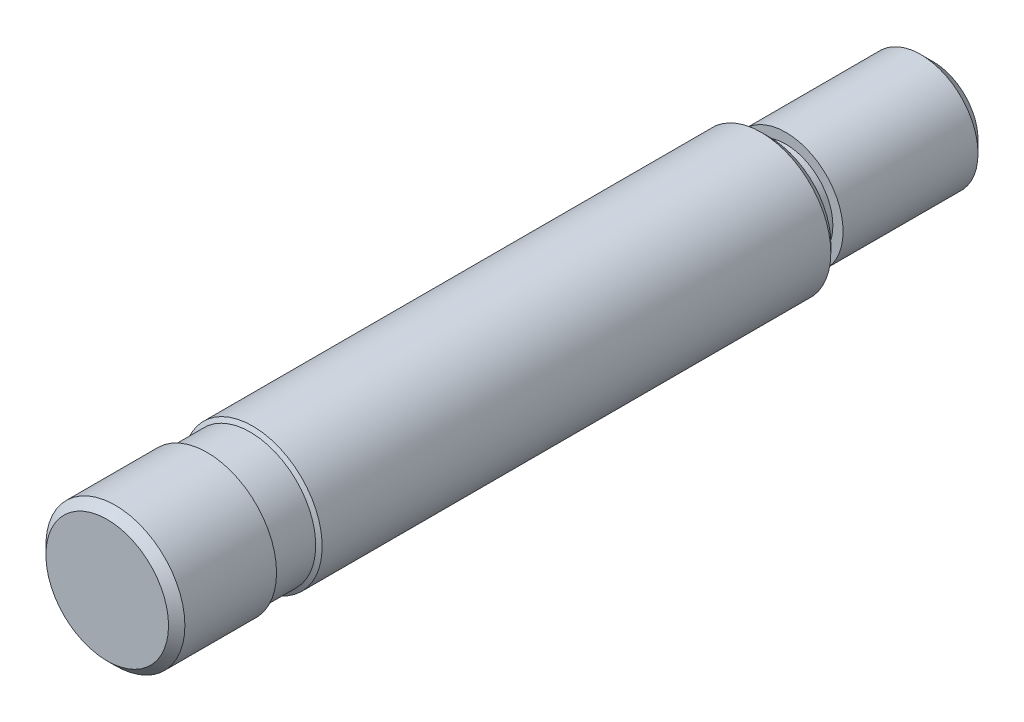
ISO-10303-21;
HEADER;
FILE_DESCRIPTION(('STEP AP214'),'2;1');
FILE_NAME('part.step','',(''),(''),'','','');
FILE_SCHEMA(('AUTOMOTIVE_DESIGN { 1 0 10303 214 1 1 1 1 }'));
ENDSEC;
DATA;
#1=APPLICATION_CONTEXT('core data for automotive mechanical design processes');
#2=APPLICATION_PROTOCOL_DEFINITION('international standard','automotive_design',2000,#1);
#3=PRODUCT_CONTEXT('',#1,'mechanical');
#4=PRODUCT('Part','Part','',(#3));
#5=PRODUCT_RELATED_PRODUCT_CATEGORY('part','',(#4));
#6=PRODUCT_DEFINITION_FORMATION('','',#4);
#7=PRODUCT_DEFINITION_CONTEXT('part definition',#1,'design');
#8=PRODUCT_DEFINITION('design','',#6,#7);
#9=PRODUCT_DEFINITION_SHAPE('','',#8);
#10=(LENGTH_UNIT() NAMED_UNIT(*) SI_UNIT(.MILLI.,.METRE.));
#11=(NAMED_UNIT(*) PLANE_ANGLE_UNIT() SI_UNIT($,.RADIAN.));
#12=(NAMED_UNIT(*) SI_UNIT($,.STERADIAN.) SOLID_ANGLE_UNIT());
#13=UNCERTAINTY_MEASURE_WITH_UNIT(LENGTH_MEASURE(1.E-05),#10,'distance_accuracy_value','');
#14=(GEOMETRIC_REPRESENTATION_CONTEXT(3) GLOBAL_UNCERTAINTY_ASSIGNED_CONTEXT((#13)) GLOBAL_UNIT_ASSIGNED_CONTEXT((#10,
#11,#12)) REPRESENTATION_CONTEXT('',''));
#15=CARTESIAN_POINT('',(0.,0.,0.));
#16=DIRECTION('',(0.,0.,1.));
#17=DIRECTION('',(1.,0.,0.));
#18=AXIS2_PLACEMENT_3D('',#15,#16,#17);
#19=CARTESIAN_POINT('',(0.,0.,81.));
#20=DIRECTION('',(0.,0.,-1.));
#21=DIRECTION('',(-1.,0.,0.));
#22=AXIS2_PLACEMENT_3D('',#19,#20,#21);
#23=CYLINDRICAL_SURFACE('',#22,8.5);
#24=CARTESIAN_POINT('',(0.,0.,63.2113248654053));
#25=DIRECTION('',(0.,0.,-1.));
#26=DIRECTION('',(-1.,0.,0.));
#27=AXIS2_PLACEMENT_3D('',#24,#25,#26);
#28=CIRCLE('',#27,8.5);
#29=CARTESIAN_POINT('',(-8.49999999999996,0.,63.2113248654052));
#30=VERTEX_POINT('',#29);
#31=EDGE_CURVE('E32',#30,#30,#28,.T.);
#32=ORIENTED_EDGE('',*,*,#31,.T.);
#33=EDGE_LOOP('',(#32));
#34=FACE_BOUND('',#33,.T.);
#35=CARTESIAN_POINT('',(0.,0.,1.));
#36=DIRECTION('',(0.,0.,1.));
#37=DIRECTION('',(1.,0.,0.));
#38=AXIS2_PLACEMENT_3D('',#35,#36,#37);
#39=CIRCLE('',#38,8.5);
#40=CARTESIAN_POINT('',(8.5,0.,1.));
#41=VERTEX_POINT('',#40);
#42=EDGE_CURVE('E41',#41,#41,#39,.T.);
#43=ORIENTED_EDGE('',*,*,#42,.T.);
#44=EDGE_LOOP('',(#43));
#45=FACE_BOUND('',#44,.T.);
#46=ADVANCED_FACE('F28',(#34,#45),#23,.T.);
#47=CARTESIAN_POINT('',(0.,0.,0.));
#48=DIRECTION('',(0.,0.,1.));
#49=DIRECTION('',(1.,0.,0.));
#50=AXIS2_PLACEMENT_3D('',#47,#48,#49);
#51=PLANE('',#50);
#52=CARTESIAN_POINT('',(0.,0.,0.));
#53=DIRECTION('',(0.,0.,1.));
#54=DIRECTION('',(1.,0.,0.));
#55=AXIS2_PLACEMENT_3D('',#52,#53,#54);
#56=CIRCLE('',#55,7.49999999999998);
#57=CARTESIAN_POINT('',(7.49999999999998,0.,0.));
#58=VERTEX_POINT('',#57);
#59=EDGE_CURVE('E36',#58,#58,#56,.F.);
#60=ORIENTED_EDGE('',*,*,#59,.T.);
#61=EDGE_LOOP('',(#60));
#62=FACE_BOUND('',#61,.T.);
#63=CARTESIAN_POINT('',(0.,0.,0.));
#64=DIRECTION('',(0.,0.,1.));
#65=DIRECTION('',(1.,0.,0.));
#66=AXIS2_PLACEMENT_3D('',#63,#64,#65);
#67=CIRCLE('',#66,5.75);
#68=CARTESIAN_POINT('',(5.75,0.,0.));
#69=VERTEX_POINT('',#68);
#70=EDGE_CURVE('E64',#69,#69,#67,.F.);
#71=ORIENTED_EDGE('',*,*,#70,.F.);
#72=EDGE_LOOP('',(#71));
#73=FACE_BOUND('',#72,.T.);
#74=ADVANCED_FACE('F97',(#62,#73),#51,.F.);
#75=CARTESIAN_POINT('',(0.,0.,-2.));
#76=DIRECTION('',(0.,0.,1.));
#77=DIRECTION('',(1.,0.,0.));
#78=AXIS2_PLACEMENT_3D('',#75,#76,#77);
#79=CYLINDRICAL_SURFACE('',#78,5.75);
#80=CARTESIAN_POINT('',(0.,0.,-2.));
#81=DIRECTION('',(0.,0.,-1.));
#82=DIRECTION('',(-1.,0.,0.));
#83=AXIS2_PLACEMENT_3D('',#80,#81,#82);
#84=CIRCLE('',#83,5.75);
#85=CARTESIAN_POINT('',(-5.75,0.,-2.));
#86=VERTEX_POINT('',#85);
#87=EDGE_CURVE('E61',#86,#86,#84,.T.);
#88=ORIENTED_EDGE('',*,*,#87,.F.);
#89=EDGE_LOOP('',(#88));
#90=FACE_BOUND('',#89,.T.);
#91=ORIENTED_EDGE('',*,*,#70,.T.);
#92=EDGE_LOOP('',(#91));
#93=FACE_BOUND('',#92,.T.);
#94=ADVANCED_FACE('F102',(#90,#93),#79,.T.);
#95=CARTESIAN_POINT('',(0.,0.,-2.));
#96=DIRECTION('',(0.,0.,-1.));
#97=DIRECTION('',(-1.,0.,0.));
#98=AXIS2_PLACEMENT_3D('',#95,#96,#97);
#99=PLANE('',#98);
#100=CARTESIAN_POINT('',(0.,0.,-2.));
#101=DIRECTION('',(0.,0.,-1.));
#102=DIRECTION('',(-1.,0.,0.));
#103=AXIS2_PLACEMENT_3D('',#100,#101,#102);
#104=CIRCLE('',#103,7.);
#105=CARTESIAN_POINT('',(-7.,0.,-2.));
#106=VERTEX_POINT('',#105);
#107=EDGE_CURVE('E50',#106,#106,#104,.T.);
#108=ORIENTED_EDGE('',*,*,#107,.F.);
#109=EDGE_LOOP('',(#108));
#110=FACE_BOUND('',#109,.T.);
#111=ORIENTED_EDGE('',*,*,#87,.T.);
#112=EDGE_LOOP('',(#111));
#113=FACE_BOUND('',#112,.T.);
#114=ADVANCED_FACE('F192',(#110,#113),#99,.F.);
#115=CARTESIAN_POINT('',(0.,0.,-20.));
#116=DIRECTION('',(0.,0.,1.));
#117=DIRECTION('',(1.,0.,0.));
#118=AXIS2_PLACEMENT_3D('',#115,#116,#117);
#119=CYLINDRICAL_SURFACE('',#118,7.);
#120=CARTESIAN_POINT('',(0.,0.,-18.5));
#121=DIRECTION('',(0.,0.,-1.));
#122=DIRECTION('',(-1.,0.,0.));
#123=AXIS2_PLACEMENT_3D('',#120,#121,#122);
#124=CIRCLE('',#123,7.);
#125=CARTESIAN_POINT('',(7.,0.,-18.5));
#126=VERTEX_POINT('',#125);
#127=EDGE_CURVE('E70',#126,#126,#124,.F.);
#128=ORIENTED_EDGE('',*,*,#127,.T.);
#129=EDGE_LOOP('',(#128));
#130=FACE_BOUND('',#129,.T.);
#131=ORIENTED_EDGE('',*,*,#107,.T.);
#132=EDGE_LOOP('',(#131));
#133=FACE_BOUND('',#132,.T.);
#134=ADVANCED_FACE('F183',(#130,#133),#119,.T.);
#135=CARTESIAN_POINT('',(0.,0.,-20.));
#136=DIRECTION('',(0.,0.,-1.));
#137=DIRECTION('',(-1.,0.,0.));
#138=AXIS2_PLACEMENT_3D('',#135,#136,#137);
#139=PLANE('',#138);
#140=CARTESIAN_POINT('',(0.,0.,-20.));
#141=DIRECTION('',(0.,0.,-1.));
#142=DIRECTION('',(-1.,0.,0.));
#143=AXIS2_PLACEMENT_3D('',#140,#141,#142);
#144=CIRCLE('',#143,5.49999999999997);
#145=CARTESIAN_POINT('',(5.49999999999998,0.,-20.));
#146=VERTEX_POINT('',#145);
#147=EDGE_CURVE('E67',#146,#146,#144,.T.);
#148=ORIENTED_EDGE('',*,*,#147,.T.);
#149=EDGE_LOOP('',(#148));
#150=FACE_BOUND('',#149,.T.);
#151=ADVANCED_FACE('F91',(#150),#139,.T.);
#152=CARTESIAN_POINT('',(0.,0.,-20.));
#153=DIRECTION('',(0.,0.,1.));
#154=DIRECTION('',(1.,0.,0.));
#155=AXIS2_PLACEMENT_3D('',#152,#153,#154);
#156=CONICAL_SURFACE('',#155,5.49999999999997,0.785398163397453);
#157=CARTESIAN_POINT('',(7.,0.,-18.5));
#158=CARTESIAN_POINT('',(6.984375,0.,-18.515625));
#159=CARTESIAN_POINT('',(6.96875,0.,-18.53125));
#160=CARTESIAN_POINT('',(6.9375,0.,-18.5625));
#161=CARTESIAN_POINT('',(6.921875,0.,-18.578125));
#162=CARTESIAN_POINT('',(6.890625,0.,-18.609375));
#163=CARTESIAN_POINT('',(6.875,0.,-18.625));
#164=CARTESIAN_POINT('',(6.84375,0.,-18.65625));
#165=CARTESIAN_POINT('',(6.828125,0.,-18.671875));
#166=CARTESIAN_POINT('',(6.796875,0.,-18.703125));
#167=CARTESIAN_POINT('',(6.78125,0.,-18.71875));
#168=CARTESIAN_POINT('',(6.75,0.,-18.75));
#169=CARTESIAN_POINT('',(6.734375,0.,-18.765625));
#170=CARTESIAN_POINT('',(6.703125,0.,-18.796875));
#171=CARTESIAN_POINT('',(6.6875,0.,-18.8125));
#172=CARTESIAN_POINT('',(6.65625,0.,-18.84375));
#173=CARTESIAN_POINT('',(6.640625,0.,-18.859375));
#174=CARTESIAN_POINT('',(6.60937499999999,0.,-18.890625));
#175=CARTESIAN_POINT('',(6.59375,0.,-18.90625));
#176=CARTESIAN_POINT('',(6.56249999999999,0.,-18.9375));
#177=CARTESIAN_POINT('',(6.54687499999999,0.,-18.953125));
#178=CARTESIAN_POINT('',(6.51562499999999,0.,-18.984375));
#179=CARTESIAN_POINT('',(6.49999999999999,0.,-19.));
#180=CARTESIAN_POINT('',(6.46874999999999,0.,-19.03125));
#181=CARTESIAN_POINT('',(6.45312499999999,0.,-19.046875));
#182=CARTESIAN_POINT('',(6.42187499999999,0.,-19.078125));
#183=CARTESIAN_POINT('',(6.40624999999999,0.,-19.09375));
#184=CARTESIAN_POINT('',(6.37499999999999,0.,-19.125));
#185=CARTESIAN_POINT('',(6.35937499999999,0.,-19.140625));
#186=CARTESIAN_POINT('',(6.32812499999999,0.,-19.171875));
#187=CARTESIAN_POINT('',(6.31249999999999,0.,-19.1875));
#188=CARTESIAN_POINT('',(6.28124999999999,0.,-19.21875));
#189=CARTESIAN_POINT('',(6.26562499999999,0.,-19.234375));
#190=CARTESIAN_POINT('',(6.23437499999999,0.,-19.265625));
#191=CARTESIAN_POINT('',(6.21874999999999,0.,-19.28125));
#192=CARTESIAN_POINT('',(6.18749999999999,0.,-19.3125));
#193=CARTESIAN_POINT('',(6.17187499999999,0.,-19.328125));
#194=CARTESIAN_POINT('',(6.14062499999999,0.,-19.359375));
#195=CARTESIAN_POINT('',(6.12499999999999,0.,-19.375));
#196=CARTESIAN_POINT('',(6.09374999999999,0.,-19.40625));
#197=CARTESIAN_POINT('',(6.07812499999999,0.,-19.421875));
#198=CARTESIAN_POINT('',(6.04687499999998,0.,-19.453125));
#199=CARTESIAN_POINT('',(6.03124999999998,0.,-19.46875));
#200=CARTESIAN_POINT('',(5.99999999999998,0.,-19.5));
#201=CARTESIAN_POINT('',(5.98437499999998,0.,-19.515625));
#202=CARTESIAN_POINT('',(5.95312499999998,0.,-19.546875));
#203=CARTESIAN_POINT('',(5.93749999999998,0.,-19.5625));
#204=CARTESIAN_POINT('',(5.90624999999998,0.,-19.59375));
#205=CARTESIAN_POINT('',(5.89062499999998,0.,-19.609375));
#206=CARTESIAN_POINT('',(5.85937499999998,0.,-19.640625));
#207=CARTESIAN_POINT('',(5.84374999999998,0.,-19.65625));
#208=CARTESIAN_POINT('',(5.81249999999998,0.,-19.6875));
#209=CARTESIAN_POINT('',(5.79687499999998,0.,-19.703125));
#210=CARTESIAN_POINT('',(5.76562499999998,0.,-19.734375));
#211=CARTESIAN_POINT('',(5.74999999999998,0.,-19.75));
#212=CARTESIAN_POINT('',(5.71874999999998,0.,-19.78125));
#213=CARTESIAN_POINT('',(5.70312499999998,0.,-19.796875));
#214=CARTESIAN_POINT('',(5.67187499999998,0.,-19.828125));
#215=CARTESIAN_POINT('',(5.65624999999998,0.,-19.84375));
#216=CARTESIAN_POINT('',(5.62499999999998,0.,-19.875));
#217=CARTESIAN_POINT('',(5.60937499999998,0.,-19.890625));
#218=CARTESIAN_POINT('',(5.57812499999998,0.,-19.921875));
#219=CARTESIAN_POINT('',(5.56249999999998,0.,-19.9375));
#220=CARTESIAN_POINT('',(5.53124999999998,0.,-19.96875));
#221=CARTESIAN_POINT('',(5.51562499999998,0.,-19.984375));
#222=CARTESIAN_POINT('',(5.49999999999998,0.,-20.));
#223=B_SPLINE_CURVE_WITH_KNOTS('',3,(#157,#158,#159,#160,#161,#162,#163,#164,#165,#166,#167,
#168,#169,#170,#171,#172,#173,#174,#175,#176,#177,#178,#179,#180,#181,#182,#183,#184,#185,#186,
#187,#188,#189,#190,#191,#192,#193,#194,#195,#196,#197,#198,#199,#200,#201,#202,#203,#204,#205,
#206,#207,#208,#209,#210,#211,#212,#213,#214,#215,#216,#217,#218,#219,#220,#221,#222),
.UNSPECIFIED.,.F.,.F.,(4,2,2,2,2,2,2,2,2,2,2,2,2,2,2,2,2,2,2,2,2,2,2,2,2,2,2,2,2,2,2,2,4),(0.,
0.0662912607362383,0.132582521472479,0.198873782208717,0.265165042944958,0.331456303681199,
0.397747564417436,0.464038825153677,0.530330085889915,0.596621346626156,0.662912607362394,
0.729203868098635,0.795495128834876,0.861786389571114,0.928077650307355,0.994368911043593,
1.06066017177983,1.12695143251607,1.19324269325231,1.25953395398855,1.32582521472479,
1.39211647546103,1.45840773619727,1.52469899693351,1.59099025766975,1.65728151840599,
1.72357277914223,1.78986403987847,1.85615530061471,1.92244656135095,1.98873782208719,
2.05502908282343,2.12132034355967),.UNSPECIFIED.);
#224=EDGE_CURVE('BSEAM82',#126,#146,#223,.T.);
#225=ORIENTED_EDGE('',*,*,#127,.F.);
#226=ORIENTED_EDGE('',*,*,#147,.F.);
#227=ORIENTED_EDGE('',*,*,#224,.T.);
#228=ORIENTED_EDGE('',*,*,#224,.F.);
#229=EDGE_LOOP('',(#225,#227,#226,#228));
#230=FACE_BOUND('',#229,.T.);
#231=ADVANCED_FACE('F82',(#230),#156,.T.);
#232=CARTESIAN_POINT('',(0.,0.,1.));
#233=DIRECTION('',(0.,0.,1.));
#234=DIRECTION('',(1.,0.,0.));
#235=AXIS2_PLACEMENT_3D('',#232,#233,#234);
#236=CONICAL_SURFACE('',#235,8.5,0.785398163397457);
#237=ORIENTED_EDGE('',*,*,#59,.F.);
#238=EDGE_LOOP('',(#237));
#239=FACE_BOUND('',#238,.T.);
#240=ORIENTED_EDGE('',*,*,#42,.F.);
#241=EDGE_LOOP('',(#240));
#242=FACE_BOUND('',#241,.T.);
#243=ADVANCED_FACE('F79',(#239,#242),#236,.T.);
#244=CARTESIAN_POINT('',(0.,0.,63.5000000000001));
#245=DIRECTION('',(0.,0.,-1.));
#246=DIRECTION('',(-1.,0.,0.));
#247=AXIS2_PLACEMENT_3D('',#244,#245,#246);
#248=CONICAL_SURFACE('',#247,8.00000000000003,1.04719755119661);
#249=CARTESIAN_POINT('',(0.,0.,63.5000000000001));
#250=DIRECTION('',(0.,0.,-1.));
#251=DIRECTION('',(-1.,0.,0.));
#252=AXIS2_PLACEMENT_3D('',#249,#250,#251);
#253=CIRCLE('',#252,8.00000000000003);
#254=CARTESIAN_POINT('',(-8.,0.,63.5));
#255=VERTEX_POINT('',#254);
#256=EDGE_CURVE('E46',#255,#255,#253,.T.);
#257=ORIENTED_EDGE('',*,*,#256,.T.);
#258=EDGE_LOOP('',(#257));
#259=FACE_BOUND('',#258,.T.);
#260=ORIENTED_EDGE('',*,*,#31,.F.);
#261=EDGE_LOOP('',(#260));
#262=FACE_BOUND('',#261,.T.);
#263=ADVANCED_FACE('F81',(#259,#262),#248,.T.);
#264=CARTESIAN_POINT('',(0.,0.,75.4293794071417));
#265=DIRECTION('',(0.,0.,1.));
#266=DIRECTION('',(1.,0.,0.));
#267=AXIS2_PLACEMENT_3D('',#264,#265,#266);
#268=CONICAL_SURFACE('',#267,20.0020371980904,1.04719755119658);
#269=CARTESIAN_POINT('',(0.,0.,68.5000000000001));
#270=DIRECTION('',(0.,0.,-1.));
#271=DIRECTION('',(-1.,0.,0.));
#272=AXIS2_PLACEMENT_3D('',#269,#270,#271);
#273=CIRCLE('',#272,7.99999999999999);
#274=CARTESIAN_POINT('',(-8.,0.,68.5));
#275=VERTEX_POINT('',#274);
#276=EDGE_CURVE('E52',#275,#275,#273,.T.);
#277=ORIENTED_EDGE('',*,*,#276,.F.);
#278=EDGE_LOOP('',(#277));
#279=FACE_BOUND('',#278,.T.);
#280=CARTESIAN_POINT('',(0.,0.,68.7886751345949));
#281=DIRECTION('',(0.,0.,1.));
#282=DIRECTION('',(1.,0.,0.));
#283=AXIS2_PLACEMENT_3D('',#280,#281,#282);
#284=CIRCLE('',#283,8.5);
#285=CARTESIAN_POINT('',(8.49999999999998,0.,68.788675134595));
#286=VERTEX_POINT('',#285);
#287=EDGE_CURVE('E44',#286,#286,#284,.T.);
#288=ORIENTED_EDGE('',*,*,#287,.F.);
#289=EDGE_LOOP('',(#288));
#290=FACE_BOUND('',#289,.T.);
#291=ADVANCED_FACE('F89',(#279,#290),#268,.T.);
#292=CARTESIAN_POINT('',(-1.11022302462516E-13,0.,79.));
#293=DIRECTION('',(0.,0.,-1.));
#294=DIRECTION('',(-1.,0.,0.));
#295=AXIS2_PLACEMENT_3D('',#292,#293,#294);
#296=CYLINDRICAL_SURFACE('',#295,8.00000000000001);
#297=ORIENTED_EDGE('',*,*,#256,.F.);
#298=EDGE_LOOP('',(#297));
#299=FACE_BOUND('',#298,.T.);
#300=ORIENTED_EDGE('',*,*,#276,.T.);
#301=EDGE_LOOP('',(#300));
#302=FACE_BOUND('',#301,.T.);
#303=ADVANCED_FACE('F118',(#299,#302),#296,.T.);
#304=CARTESIAN_POINT('',(0.,0.,81.));
#305=DIRECTION('',(0.,0.,1.));
#306=DIRECTION('',(1.,0.,0.));
#307=AXIS2_PLACEMENT_3D('',#304,#305,#306);
#308=PLANE('',#307);
#309=CARTESIAN_POINT('',(0.,0.,81.));
#310=DIRECTION('',(0.,0.,1.));
#311=DIRECTION('',(1.,0.,0.));
#312=AXIS2_PLACEMENT_3D('',#309,#310,#311);
#313=CIRCLE('',#312,7.49999999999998);
#314=CARTESIAN_POINT('',(7.49999999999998,0.,81.));
#315=VERTEX_POINT('',#314);
#316=EDGE_CURVE('E10',#315,#315,#313,.T.);
#317=ORIENTED_EDGE('',*,*,#316,.T.);
#318=EDGE_LOOP('',(#317));
#319=FACE_BOUND('',#318,.T.);
#320=ADVANCED_FACE('F110',(#319),#308,.T.);
#321=CARTESIAN_POINT('',(0.,0.,81.));
#322=DIRECTION('',(0.,0.,-1.));
#323=DIRECTION('',(-1.,0.,0.));
#324=AXIS2_PLACEMENT_3D('',#321,#322,#323);
#325=CONICAL_SURFACE('',#324,7.49999999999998,0.785398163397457);
#326=CARTESIAN_POINT('',(0.,0.,80.));
#327=DIRECTION('',(0.,0.,1.));
#328=DIRECTION('',(1.,0.,0.));
#329=AXIS2_PLACEMENT_3D('',#326,#327,#328);
#330=CIRCLE('',#329,8.5);
#331=CARTESIAN_POINT('',(8.5,0.,80.));
#332=VERTEX_POINT('',#331);
#333=EDGE_CURVE('E73',#332,#332,#330,.F.);
#334=ORIENTED_EDGE('',*,*,#333,.F.);
#335=EDGE_LOOP('',(#334));
#336=FACE_BOUND('',#335,.T.);
#337=ORIENTED_EDGE('',*,*,#316,.F.);
#338=EDGE_LOOP('',(#337));
#339=FACE_BOUND('',#338,.T.);
#340=ADVANCED_FACE('F106',(#336,#339),#325,.T.);
#341=ORIENTED_EDGE('',*,*,#287,.T.);
#342=EDGE_LOOP('',(#341));
#343=FACE_BOUND('',#342,.T.);
#344=ORIENTED_EDGE('',*,*,#333,.T.);
#345=EDGE_LOOP('',(#344));
#346=FACE_BOUND('',#345,.T.);
#347=ADVANCED_FACE('F30',(#343,#346),#23,.T.);
#348=CLOSED_SHELL('',(#46,#74,#94,#114,#134,#151,#231,#243,#263,#291,#303,#320,#340,#347));
#349=MANIFOLD_SOLID_BREP('B2',#348);
#350=ADVANCED_BREP_SHAPE_REPRESENTATION('',(#18,#349),#14);
#351=SHAPE_DEFINITION_REPRESENTATION(#9,#350);
ENDSEC;
END-ISO-10303-21;
